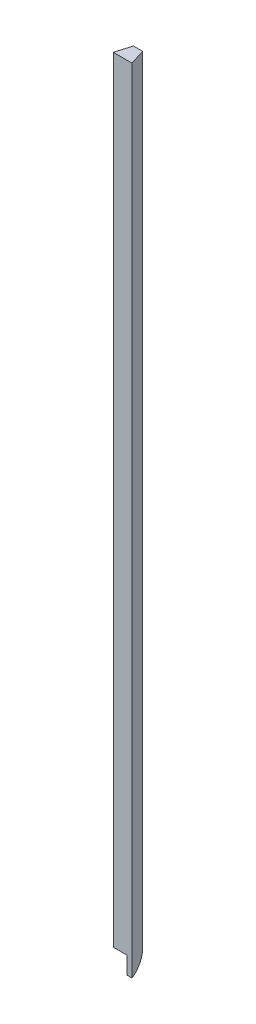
from build123d import *

# Parameters (mm, degrees)
BOSS_EXTRUDE1_DEPTH = 635
BOSS_EXTRUDE2_DEPTH = 14.224
CUT_EXTRUDE1_DEPTH  = 636.229828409


with BuildPart() as part:
    # Sketch1 → Boss-Extrude1 (new body)
    with BuildSketch(Plane(origin=(0, 0, 0), x_dir=(1, 0, 0), z_dir=(0, 1, 0))):
        Polygon((-7.62, 0), (7.62, 0), (3.81, 12.7), (-3.81, 12.7), align=None)
    extrude(amount=BOSS_EXTRUDE1_DEPTH)

    # Sketch2 → Boss-Extrude2 (add)
    with BuildSketch(Plane.XZ):
        Polygon((3.81, 0), (3.81, -12.7), (7.62, 0), align=None)
    extrude(amount=BOSS_EXTRUDE2_DEPTH)

    # Sketch3 → Cut-Extrude1 (cut, through all)
    with BuildSketch(Plane.ZY.offset(-3.81)):
        with BuildLine():
            Line((-12.7, -1.524), (-12.7, -14.224))
            Line((-12.7, -14.224), (0, -14.224))
            ThreePointArc((0, -14.224), (-8.772308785, -10.296308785), (-12.7, -1.524))
        make_face()
    extrude(amount=-CUT_EXTRUDE1_DEPTH, mode=Mode.SUBTRACT)


solid = part.part
